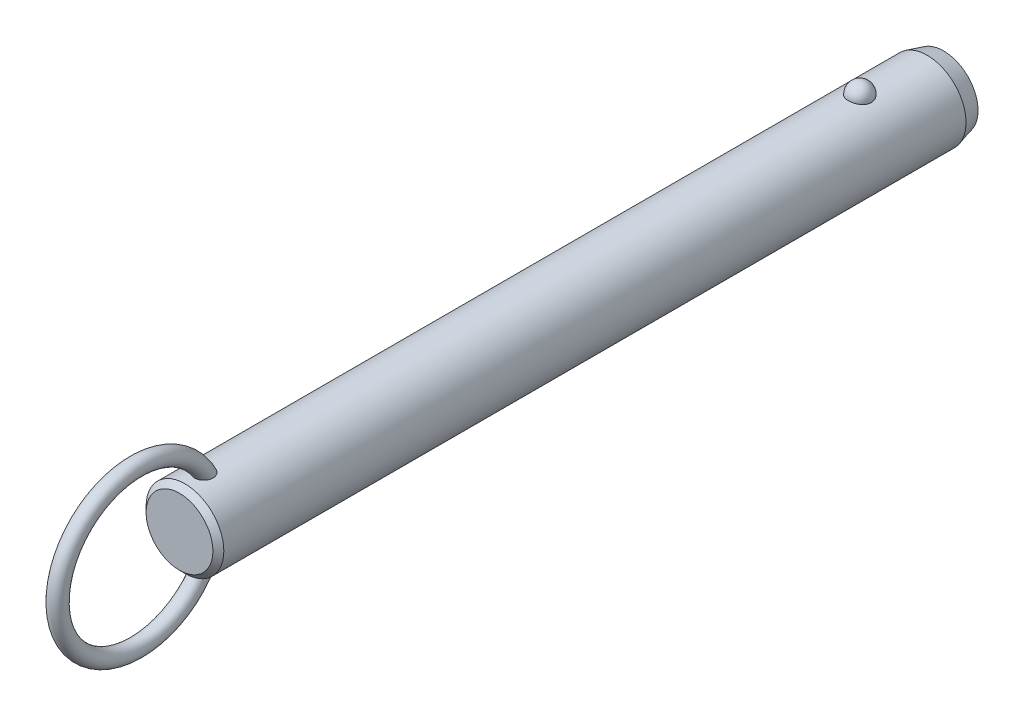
ISO-10303-21;
HEADER;
FILE_DESCRIPTION(('STEP AP214'),'2;1');
FILE_NAME('part.step','',(''),(''),'','','');
FILE_SCHEMA(('AUTOMOTIVE_DESIGN { 1 0 10303 214 1 1 1 1 }'));
ENDSEC;
DATA;
#1=APPLICATION_CONTEXT('core data for automotive mechanical design processes');
#2=APPLICATION_PROTOCOL_DEFINITION('international standard','automotive_design',2000,#1);
#3=PRODUCT_CONTEXT('',#1,'mechanical');
#4=PRODUCT('Part','Part','',(#3));
#5=PRODUCT_RELATED_PRODUCT_CATEGORY('part','',(#4));
#6=PRODUCT_DEFINITION_FORMATION('','',#4);
#7=PRODUCT_DEFINITION_CONTEXT('part definition',#1,'design');
#8=PRODUCT_DEFINITION('design','',#6,#7);
#9=PRODUCT_DEFINITION_SHAPE('','',#8);
#10=(LENGTH_UNIT() NAMED_UNIT(*) SI_UNIT(.MILLI.,.METRE.));
#11=(NAMED_UNIT(*) PLANE_ANGLE_UNIT() SI_UNIT($,.RADIAN.));
#12=(NAMED_UNIT(*) SI_UNIT($,.STERADIAN.) SOLID_ANGLE_UNIT());
#13=UNCERTAINTY_MEASURE_WITH_UNIT(LENGTH_MEASURE(1.E-05),#10,'distance_accuracy_value','');
#14=(GEOMETRIC_REPRESENTATION_CONTEXT(3) GLOBAL_UNCERTAINTY_ASSIGNED_CONTEXT((#13)) GLOBAL_UNIT_ASSIGNED_CONTEXT((#10,
#11,#12)) REPRESENTATION_CONTEXT('',''));
#15=CARTESIAN_POINT('',(0.,0.,0.));
#16=DIRECTION('',(0.,0.,1.));
#17=DIRECTION('',(1.,0.,0.));
#18=AXIS2_PLACEMENT_3D('',#15,#16,#17);
#19=CARTESIAN_POINT('',(0.,0.,114.3));
#20=DIRECTION('',(0.,0.,-1.));
#21=DIRECTION('',(-1.,0.,0.));
#22=AXIS2_PLACEMENT_3D('',#19,#20,#21);
#23=CYLINDRICAL_SURFACE('',#22,7.1);
#24=CARTESIAN_POINT('',(2.0769088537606,6.78943661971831,-2.1));
#25=CARTESIAN_POINT('',(2.07690739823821,6.78943796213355,-1.98268154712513));
#26=CARTESIAN_POINT('',(2.06738130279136,6.79237331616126,-1.86534506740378));
#27=CARTESIAN_POINT('',(2.0295040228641,6.8037853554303,-1.63400788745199));
#28=CARTESIAN_POINT('',(2.00114757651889,6.81226358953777,-1.52000812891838));
#29=CARTESIAN_POINT('',(1.92632025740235,6.83379798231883,-1.29863433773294));
#30=CARTESIAN_POINT('',(1.87985726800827,6.84685214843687,-1.19125744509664));
#31=CARTESIAN_POINT('',(1.76995205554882,6.87608091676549,-0.98604657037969));
#32=CARTESIAN_POINT('',(1.70650980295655,6.8922555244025,-0.88821260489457));
#33=CARTESIAN_POINT('',(1.5638119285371,6.92602930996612,-0.704242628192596));
#34=CARTESIAN_POINT('',(1.4844714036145,6.94363582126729,-0.618173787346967));
#35=CARTESIAN_POINT('',(1.31221746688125,6.97823658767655,-0.460740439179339));
#36=CARTESIAN_POINT('',(1.21930409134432,6.99523084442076,-0.389375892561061));
#37=CARTESIAN_POINT('',(1.02268781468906,7.02666176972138,-0.263547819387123));
#38=CARTESIAN_POINT('',(0.91902009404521,7.04110638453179,-0.209031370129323));
#39=CARTESIAN_POINT('',(0.703548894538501,7.06588726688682,-0.118163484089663));
#40=CARTESIAN_POINT('',(0.591746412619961,7.07622403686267,-0.0818098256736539));
#41=CARTESIAN_POINT('',(0.365557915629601,7.09147068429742,-0.0288711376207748));
#42=CARTESIAN_POINT('',(0.251267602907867,7.09648447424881,-0.0119070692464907));
#43=CARTESIAN_POINT('',(0.0213499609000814,7.10089837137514,0.00304925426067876));
#44=CARTESIAN_POINT('',(-0.0942772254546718,7.10029907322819,0.00104351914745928));
#45=CARTESIAN_POINT('',(-0.321651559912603,7.09360829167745,-0.0216931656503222));
#46=CARTESIAN_POINT('',(-0.433431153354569,7.08760388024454,-0.0421272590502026));
#47=CARTESIAN_POINT('',(-0.651862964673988,7.07086131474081,-0.100729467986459));
#48=CARTESIAN_POINT('',(-0.758515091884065,7.06012307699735,-0.138897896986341));
#49=CARTESIAN_POINT('',(-0.964449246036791,7.03496097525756,-0.232213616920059));
#50=CARTESIAN_POINT('',(-1.06368095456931,7.02051445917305,-0.287465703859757));
#51=CARTESIAN_POINT('',(-1.25145353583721,6.98948740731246,-0.413383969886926));
#52=CARTESIAN_POINT('',(-1.33999321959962,6.97290663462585,-0.48405186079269));
#53=CARTESIAN_POINT('',(-1.50591604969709,6.93898770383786,-0.640594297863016));
#54=CARTESIAN_POINT('',(-1.58302488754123,6.92164094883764,-0.726757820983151));
#55=CARTESIAN_POINT('',(-1.72189320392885,6.8884103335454,-0.91092752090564));
#56=CARTESIAN_POINT('',(-1.78365144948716,6.87252659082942,-1.008934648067));
#57=CARTESIAN_POINT('',(-1.89101272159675,6.84377189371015,-1.21549497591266));
#58=CARTESIAN_POINT('',(-1.93639553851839,6.83094274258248,-1.32416860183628));
#59=CARTESIAN_POINT('',(-2.00874275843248,6.81002070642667,-1.54791500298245));
#60=CARTESIAN_POINT('',(-2.03570774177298,6.80192767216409,-1.66298757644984));
#61=CARTESIAN_POINT('',(-2.07047276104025,6.7914266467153,-1.89571453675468));
#62=CARTESIAN_POINT('',(-2.07835878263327,6.78899315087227,-2.01335491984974));
#63=CARTESIAN_POINT('',(-2.07502083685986,6.79001409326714,-2.24833570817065));
#64=CARTESIAN_POINT('',(-2.06379746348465,6.7934683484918,-2.36567612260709));
#65=CARTESIAN_POINT('',(-2.02263913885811,6.80583442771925,-2.59603194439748));
#66=CARTESIAN_POINT('',(-1.99281127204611,6.81471501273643,-2.70906820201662));
#67=CARTESIAN_POINT('',(-1.91526639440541,6.83691232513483,-2.92836575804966));
#68=CARTESIAN_POINT('',(-1.8675486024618,6.85022924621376,-3.03462676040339));
#69=CARTESIAN_POINT('',(-1.75504492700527,6.87991336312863,-3.23806487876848));
#70=CARTESIAN_POINT('',(-1.69015924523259,6.89629822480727,-3.33518422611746));
#71=CARTESIAN_POINT('',(-1.54505404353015,6.93024852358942,-3.51697105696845));
#72=CARTESIAN_POINT('',(-1.46483385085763,6.94781401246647,-3.60163799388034));
#73=CARTESIAN_POINT('',(-1.29071406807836,6.98225977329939,-3.75654119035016));
#74=CARTESIAN_POINT('',(-1.19675650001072,6.99913673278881,-3.82671308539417));
#75=CARTESIAN_POINT('',(-0.997940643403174,7.03023618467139,-3.9501837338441));
#76=CARTESIAN_POINT('',(-0.89308318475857,7.04445887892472,-4.00348377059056));
#77=CARTESIAN_POINT('',(-0.676902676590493,7.06848365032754,-4.09107242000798));
#78=CARTESIAN_POINT('',(-0.565686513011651,7.0783430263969,-4.12560889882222));
#79=CARTESIAN_POINT('',(-0.338739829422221,7.09282534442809,-4.17575450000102));
#80=CARTESIAN_POINT('',(-0.223009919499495,7.09744899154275,-4.19136617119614));
#81=CARTESIAN_POINT('',(0.00707628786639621,7.10090930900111,-4.20307965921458));
#82=CARTESIAN_POINT('',(0.121410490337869,7.09986531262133,-4.19958377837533));
#83=CARTESIAN_POINT('',(0.347815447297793,7.092380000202,-4.17411564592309));
#84=CARTESIAN_POINT('',(0.459886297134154,7.08593891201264,-4.15214417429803));
#85=CARTESIAN_POINT('',(0.678084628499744,7.06838983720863,-4.09049562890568));
#86=CARTESIAN_POINT('',(0.784237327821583,7.05730369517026,-4.05090137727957));
#87=CARTESIAN_POINT('',(0.988305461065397,7.03163139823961,-3.95511447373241));
#88=CARTESIAN_POINT('',(1.08622031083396,7.01704499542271,-3.89892064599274));
#89=CARTESIAN_POINT('',(1.27284490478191,6.98562668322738,-3.77035541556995));
#90=CARTESIAN_POINT('',(1.36137372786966,6.96876135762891,-3.69772964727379));
#91=CARTESIAN_POINT('',(1.52509486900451,6.93477412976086,-3.53878279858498));
#92=CARTESIAN_POINT('',(1.60028496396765,6.91765218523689,-3.45245943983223));
#93=CARTESIAN_POINT('',(1.73681688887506,6.88465753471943,-3.26658774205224));
#94=CARTESIAN_POINT('',(1.79785966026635,6.86881574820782,-3.16681408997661));
#95=CARTESIAN_POINT('',(1.90265327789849,6.84053157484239,-2.95814408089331));
#96=CARTESIAN_POINT('',(1.94640861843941,6.82808830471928,-2.84925010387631));
#97=CARTESIAN_POINT('',(2.01274378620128,6.80881460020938,-2.63454318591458));
#98=CARTESIAN_POINT('',(2.03676193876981,6.80160856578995,-2.52920574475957));
#99=CARTESIAN_POINT('',(2.06884490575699,6.79191902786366,-2.3159172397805));
#100=CARTESIAN_POINT('',(2.07691019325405,6.78943538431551,-2.20796625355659));
#101=CARTESIAN_POINT('',(2.0769088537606,6.78943661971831,-2.1));
#102=B_SPLINE_CURVE_WITH_KNOTS('',3,(#24,#25,#26,#27,#28,#29,#30,#31,#32,#33,#34,#35,#36,#37,
#38,#39,#40,#41,#42,#43,#44,#45,#46,#47,#48,#49,#50,#51,#52,#53,#54,#55,#56,#57,#58,#59,#60,#61,
#62,#63,#64,#65,#66,#67,#68,#69,#70,#71,#72,#73,#74,#75,#76,#77,#78,#79,#80,#81,#82,#83,#84,#85,
#86,#87,#88,#89,#90,#91,#92,#93,#94,#95,#96,#97,#98,#99,#100,#101),.UNSPECIFIED.,.T.,.F.,(4,2,2,
2,2,2,2,2,2,2,2,2,2,2,2,2,2,2,2,2,2,2,2,2,2,2,2,2,2,2,2,2,2,2,2,2,2,2,4),(0.,0.351568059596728,
0.703234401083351,1.05474780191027,1.40626181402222,1.75970563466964,2.11314851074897,
2.4654696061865,2.81774759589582,3.16301449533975,3.50824481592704,3.84801136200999,
4.18778391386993,4.52968352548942,4.87162112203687,5.22076181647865,5.56993054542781,
5.92363364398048,6.27732559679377,6.62942052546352,6.98150450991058,7.33158042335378,
7.68167162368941,8.03384443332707,8.38603269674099,8.73975272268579,9.09344583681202,
9.44234545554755,9.79119807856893,10.1327344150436,10.4742563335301,10.8141898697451,
11.1541474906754,11.4997793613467,11.8454687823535,12.1979079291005,12.5502553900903,
12.8738073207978,13.1973496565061),.UNSPECIFIED.);
#103=CARTESIAN_POINT('',(2.0769088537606,6.78943661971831,-2.1));
#104=VERTEX_POINT('',#103);
#105=EDGE_CURVE('E41',#104,#104,#102,.T.);
#106=ORIENTED_EDGE('',*,*,#105,.T.);
#107=EDGE_LOOP('',(#106));
#108=FACE_BOUND('',#107,.T.);
#109=CARTESIAN_POINT('',(0.,0.,121.22));
#110=DIRECTION('',(0.,0.,1.));
#111=DIRECTION('',(1.,0.,0.));
#112=AXIS2_PLACEMENT_3D('',#109,#110,#111);
#113=CIRCLE('',#112,7.1);
#114=CARTESIAN_POINT('',(7.1,0.,121.22));
#115=VERTEX_POINT('',#114);
#116=EDGE_CURVE('E10',#115,#115,#113,.F.);
#117=ORIENTED_EDGE('',*,*,#116,.T.);
#118=EDGE_LOOP('',(#117));
#119=FACE_BOUND('',#118,.T.);
#120=CARTESIAN_POINT('',(-0.429539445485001,-7.08699541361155,116.042921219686));
#121=CARTESIAN_POINT('',(-0.508331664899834,-7.08221999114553,116.066876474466));
#122=CARTESIAN_POINT('',(-0.585039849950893,-7.07624016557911,116.097457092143));
#123=CARTESIAN_POINT('',(-0.732082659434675,-7.06254296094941,116.171024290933));
#124=CARTESIAN_POINT('',(-0.802417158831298,-7.05482554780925,116.214011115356));
#125=CARTESIAN_POINT('',(-0.934722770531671,-7.03851844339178,116.311113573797));
#126=CARTESIAN_POINT('',(-0.996700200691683,-7.02992941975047,116.365220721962));
#127=CARTESIAN_POINT('',(-1.11079942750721,-7.01280697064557,116.482967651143));
#128=CARTESIAN_POINT('',(-1.16292136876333,-7.00427354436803,116.546607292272));
#129=CARTESIAN_POINT('',(-1.25705660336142,-6.98799959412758,116.682687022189));
#130=CARTESIAN_POINT('',(-1.2988803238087,-6.98027525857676,116.755259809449));
#131=CARTESIAN_POINT('',(-1.37069920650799,-6.96652886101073,116.906168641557));
#132=CARTESIAN_POINT('',(-1.40069157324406,-6.96050720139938,116.984506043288));
#133=CARTESIAN_POINT('',(-1.45043507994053,-6.95031881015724,117.150190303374));
#134=CARTESIAN_POINT('',(-1.46937115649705,-6.94630231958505,117.237789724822));
#135=CARTESIAN_POINT('',(-1.49424917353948,-6.94099239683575,117.414871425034));
#136=CARTESIAN_POINT('',(-1.50018601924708,-6.93970003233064,117.504354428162));
#137=CARTESIAN_POINT('',(-1.49978214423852,-6.93978815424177,117.694060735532));
#138=CARTESIAN_POINT('',(-1.49187639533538,-6.94150934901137,117.794279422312));
#139=CARTESIAN_POINT('',(-1.46177925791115,-6.94790814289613,117.992479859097));
#140=CARTESIAN_POINT('',(-1.43957541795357,-6.95258831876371,118.090459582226));
#141=CARTESIAN_POINT('',(-1.37783293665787,-6.96510647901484,118.29536292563));
#142=CARTESIAN_POINT('',(-1.33634073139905,-6.97328848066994,118.401680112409));
#143=CARTESIAN_POINT('',(-1.23686994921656,-6.99161706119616,118.606177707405));
#144=CARTESIAN_POINT('',(-1.17889192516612,-7.00176357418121,118.704358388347));
#145=CARTESIAN_POINT('',(-1.05875124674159,-7.02082898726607,118.872374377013));
#146=CARTESIAN_POINT('',(-0.999247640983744,-7.02963746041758,118.944123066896));
#147=CARTESIAN_POINT('',(-0.869494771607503,-7.04686074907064,119.077195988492));
#148=CARTESIAN_POINT('',(-0.799263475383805,-7.05527619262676,119.138537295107));
#149=CARTESIAN_POINT('',(-0.665408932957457,-7.06899457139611,119.235131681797));
#150=CARTESIAN_POINT('',(-0.603817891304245,-7.07457275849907,119.273151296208));
#151=CARTESIAN_POINT('',(-0.47517283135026,-7.08437420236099,119.338758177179));
#152=CARTESIAN_POINT('',(-0.408123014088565,-7.08859848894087,119.366353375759));
#153=CARTESIAN_POINT('',(-0.269431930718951,-7.09522749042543,119.409256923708));
#154=CARTESIAN_POINT('',(-0.19775731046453,-7.09761688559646,119.424461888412));
#155=CARTESIAN_POINT('',(-0.0527849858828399,-7.10017268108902,119.440716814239));
#156=CARTESIAN_POINT('',(0.0205115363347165,-7.10034065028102,119.441776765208));
#157=CARTESIAN_POINT('',(0.156426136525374,-7.09855986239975,119.430461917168));
#158=CARTESIAN_POINT('',(0.219199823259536,-7.09688191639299,119.419806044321));
#159=CARTESIAN_POINT('',(0.342134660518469,-7.09201880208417,119.388537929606));
#160=CARTESIAN_POINT('',(0.402295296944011,-7.08883333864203,119.367923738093));
#161=CARTESIAN_POINT('',(0.520687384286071,-7.08113868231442,119.317212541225));
#162=CARTESIAN_POINT('',(0.578791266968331,-7.07658958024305,119.286827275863));
#163=CARTESIAN_POINT('',(0.690173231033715,-7.06659708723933,119.218367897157));
#164=CARTESIAN_POINT('',(0.74344785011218,-7.061153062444,119.180288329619));
#165=CARTESIAN_POINT('',(0.870947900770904,-7.04680292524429,119.076592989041));
#166=CARTESIAN_POINT('',(0.941828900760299,-7.0375580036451,119.006897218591));
#167=CARTESIAN_POINT('',(1.07136606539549,-7.01900793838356,118.856945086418));
#168=CARTESIAN_POINT('',(1.13000013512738,-7.00970271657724,118.776670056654));
#169=CARTESIAN_POINT('',(1.23579584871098,-6.99183327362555,118.606899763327));
#170=CARTESIAN_POINT('',(1.28274271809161,-6.98328455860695,118.517269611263));
#171=CARTESIAN_POINT('',(1.36351442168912,-6.96796352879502,118.332176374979));
#172=CARTESIAN_POINT('',(1.39733971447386,-6.96119115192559,118.236713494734));
#173=CARTESIAN_POINT('',(1.45579181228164,-6.94922464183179,118.02530928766));
#174=CARTESIAN_POINT('',(1.47790145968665,-6.94449000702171,117.908631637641));
#175=CARTESIAN_POINT('',(1.50168752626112,-6.93938731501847,117.673015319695));
#176=CARTESIAN_POINT('',(1.50336085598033,-6.93901991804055,117.55407631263));
#177=CARTESIAN_POINT('',(1.48486516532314,-6.9430010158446,117.32360799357));
#178=CARTESIAN_POINT('',(1.46573441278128,-6.9471253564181,117.211995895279));
#179=CARTESIAN_POINT('',(1.40606892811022,-6.95944667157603,116.994886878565));
#180=CARTESIAN_POINT('',(1.36556446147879,-6.96763788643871,116.8893815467));
#181=CARTESIAN_POINT('',(1.27082700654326,-6.98548038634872,116.704287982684));
#182=CARTESIAN_POINT('',(1.21949810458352,-6.99473841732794,116.623171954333));
#183=CARTESIAN_POINT('',(1.10242050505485,-7.01414069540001,116.472227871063));
#184=CARTESIAN_POINT('',(1.0366811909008,-7.02428436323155,116.40239252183));
#185=CARTESIAN_POINT('',(0.900559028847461,-7.04295285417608,116.283573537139));
#186=CARTESIAN_POINT('',(0.831428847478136,-7.05153466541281,116.233157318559));
#187=CARTESIAN_POINT('',(0.685291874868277,-7.06723150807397,116.145142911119));
#188=CARTESIAN_POINT('',(0.608287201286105,-7.0743469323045,116.107541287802));
#189=CARTESIAN_POINT('',(0.451878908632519,-7.08602232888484,116.047491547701));
#190=CARTESIAN_POINT('',(0.372686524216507,-7.09067127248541,116.024508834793));
#191=CARTESIAN_POINT('',(0.211477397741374,-7.09730788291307,115.992035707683));
#192=CARTESIAN_POINT('',(0.12946098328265,-7.09929585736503,115.98254373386));
#193=CARTESIAN_POINT('',(-0.0332905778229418,-7.10037858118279,115.977351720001));
#194=CARTESIAN_POINT('',(-0.114016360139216,-7.09953334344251,115.981365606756));
#195=CARTESIAN_POINT('',(-0.273670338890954,-7.09517338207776,116.002454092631));
#196=CARTESIAN_POINT('',(-0.352598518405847,-7.09165863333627,116.019528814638));
#197=CARTESIAN_POINT('',(-0.429539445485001,-7.08699541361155,116.042921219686));
#198=B_SPLINE_CURVE_WITH_KNOTS('',3,(#120,#121,#122,#123,#124,#125,#126,#127,#128,#129,#130,
#131,#132,#133,#134,#135,#136,#137,#138,#139,#140,#141,#142,#143,#144,#145,#146,#147,#148,#149,
#150,#151,#152,#153,#154,#155,#156,#157,#158,#159,#160,#161,#162,#163,#164,#165,#166,#167,#168,
#169,#170,#171,#172,#173,#174,#175,#176,#177,#178,#179,#180,#181,#182,#183,#184,#185,#186,#187,
#188,#189,#190,#191,#192,#193,#194,#195,#196,#197),.UNSPECIFIED.,.T.,.F.,(4,2,2,2,2,2,2,2,2,2,2,
2,2,2,2,2,2,2,2,2,2,2,2,2,2,2,2,2,2,2,2,2,2,2,2,2,2,2,4),(0.,0.247183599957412,
0.494372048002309,0.741372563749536,0.988369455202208,1.23962059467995,1.49093106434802,
1.75897818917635,2.02713035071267,2.32758265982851,2.62829697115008,2.97008736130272,
3.31186629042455,3.59175319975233,3.87117637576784,4.08813841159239,4.30493502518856,
4.52352259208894,4.7419557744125,4.93215328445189,5.12238804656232,5.31884850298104,
5.51544871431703,5.81332317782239,6.11173048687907,6.41527266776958,6.71880423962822,
7.07358156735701,7.42841252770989,7.76631485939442,8.10373999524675,8.39142246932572,
8.67891817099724,8.93560332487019,9.19221962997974,9.43881106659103,9.68537399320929,
9.92674752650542,10.1681233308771),.UNSPECIFIED.);
#199=CARTESIAN_POINT('',(-0.429539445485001,-7.08699541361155,116.042921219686));
#200=VERTEX_POINT('',#199);
#201=EDGE_CURVE('E59',#200,#200,#198,.T.);
#202=ORIENTED_EDGE('',*,*,#201,.T.);
#203=EDGE_LOOP('',(#202));
#204=FACE_BOUND('',#203,.T.);
#205=CARTESIAN_POINT('',(-0.429539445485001,7.08699541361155,116.042921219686));
#206=CARTESIAN_POINT('',(-0.351665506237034,7.09171429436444,116.019246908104));
#207=CARTESIAN_POINT('',(-0.271733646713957,7.09525896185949,116.002036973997));
#208=CARTESIAN_POINT('',(-0.110026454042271,7.09960839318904,115.981005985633));
#209=CARTESIAN_POINT('',(-0.0282502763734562,7.10041187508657,115.977191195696));
#210=CARTESIAN_POINT('',(0.134782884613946,7.09918849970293,115.983059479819));
#211=CARTESIAN_POINT('',(0.21603995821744,7.09716214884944,115.99274013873));
#212=CARTESIAN_POINT('',(0.375730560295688,7.09050177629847,116.025347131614));
#213=CARTESIAN_POINT('',(0.454164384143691,7.08586802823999,116.048272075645));
#214=CARTESIAN_POINT('',(0.606025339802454,7.07449911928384,116.106771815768));
#215=CARTESIAN_POINT('',(0.679451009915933,7.06776334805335,116.142350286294));
#216=CARTESIAN_POINT('',(0.81923414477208,7.05292866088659,116.225175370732));
#217=CARTESIAN_POINT('',(0.885591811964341,7.04482978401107,116.272421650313));
#218=CARTESIAN_POINT('',(1.00993211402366,7.02808709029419,116.377590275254));
#219=CARTESIAN_POINT('',(1.06785399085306,7.01943990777,116.435583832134));
#220=CARTESIAN_POINT('',(1.17342527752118,7.00256662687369,116.560301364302));
#221=CARTESIAN_POINT('',(1.22107408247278,6.99434055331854,116.627025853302));
#222=CARTESIAN_POINT('',(1.30652927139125,6.97889183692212,116.769362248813));
#223=CARTESIAN_POINT('',(1.34399711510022,6.97170674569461,116.845180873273));
#224=CARTESIAN_POINT('',(1.40682616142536,6.95930080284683,117.001810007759));
#225=CARTESIAN_POINT('',(1.43218374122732,6.95408053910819,117.08262200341));
#226=CARTESIAN_POINT('',(1.47246409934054,6.94566853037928,117.253531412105));
#227=CARTESIAN_POINT('',(1.48642590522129,6.9426653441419,117.34386307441));
#228=CARTESIAN_POINT('',(1.5011410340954,6.93949744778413,117.525619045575));
#229=CARTESIAN_POINT('',(1.50188917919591,6.93933385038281,117.617043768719));
#230=CARTESIAN_POINT('',(1.49030464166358,6.94183245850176,117.81084381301));
#231=CARTESIAN_POINT('',(1.47627413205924,6.94486147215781,117.913112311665));
#232=CARTESIAN_POINT('',(1.43356351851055,6.95380194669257,118.114471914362));
#233=CARTESIAN_POINT('',(1.4048676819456,6.95971650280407,118.213559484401));
#234=CARTESIAN_POINT('',(1.32908750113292,6.97461208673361,118.418908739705));
#235=CARTESIAN_POINT('',(1.28011435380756,6.98388945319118,118.524456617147));
#236=CARTESIAN_POINT('',(1.16520357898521,7.00397743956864,118.725760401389));
#237=CARTESIAN_POINT('',(1.09927694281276,7.01478706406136,118.821522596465));
#238=CARTESIAN_POINT('',(0.969361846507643,7.03373936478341,118.976756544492));
#239=CARTESIAN_POINT('',(0.909042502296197,7.04187023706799,119.039303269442));
#240=CARTESIAN_POINT('',(0.779178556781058,7.05741732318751,119.154053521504));
#241=CARTESIAN_POINT('',(0.709649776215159,7.06483472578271,119.206274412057));
#242=CARTESIAN_POINT('',(0.576854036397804,7.0767751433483,119.288113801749));
#243=CARTESIAN_POINT('',(0.515118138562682,7.08158033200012,119.320164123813));
#244=CARTESIAN_POINT('',(0.387127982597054,7.08972701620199,119.373765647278));
#245=CARTESIAN_POINT('',(0.320877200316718,7.09306962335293,119.395324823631));
#246=CARTESIAN_POINT('',(0.18504126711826,7.09791507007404,119.426400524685));
#247=CARTESIAN_POINT('',(0.115437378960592,7.09940591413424,119.435838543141));
#248=CARTESIAN_POINT('',(-0.024315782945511,7.10030171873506,119.441522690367));
#249=CARTESIAN_POINT('',(-0.0944648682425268,7.0997073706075,119.437773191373));
#250=CARTESIAN_POINT('',(-0.225713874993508,7.09668414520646,119.418508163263));
#251=CARTESIAN_POINT('',(-0.287006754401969,7.09444865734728,119.404232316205));
#252=CARTESIAN_POINT('',(-0.406555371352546,7.08860360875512,119.366368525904));
#253=CARTESIAN_POINT('',(-0.464809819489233,7.08499346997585,119.342776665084));
#254=CARTESIAN_POINT('',(-0.594955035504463,7.07541654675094,119.278923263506));
#255=CARTESIAN_POINT('',(-0.665389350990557,7.06906574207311,119.235753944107));
#256=CARTESIAN_POINT('',(-0.798242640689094,7.05530261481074,119.138587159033));
#257=CARTESIAN_POINT('',(-0.860645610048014,7.0478882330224,119.084568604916));
#258=CARTESIAN_POINT('',(-0.99424943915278,7.03045217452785,118.950996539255));
#259=CARTESIAN_POINT('',(-1.06260129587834,7.02030745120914,118.868614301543));
#260=CARTESIAN_POINT('',(-1.18502045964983,7.00068382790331,118.693843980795));
#261=CARTESIAN_POINT('',(-1.239076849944,6.99120544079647,118.601448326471));
#262=CARTESIAN_POINT('',(-1.33335589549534,6.97384343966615,118.408008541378));
#263=CARTESIAN_POINT('',(-1.3733613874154,6.96598557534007,118.306856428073));
#264=CARTESIAN_POINT('',(-1.43770677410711,6.9529905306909,118.099504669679));
#265=CARTESIAN_POINT('',(-1.46204473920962,6.94785368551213,117.99330440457));
#266=CARTESIAN_POINT('',(-1.49537533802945,6.94076296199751,117.768231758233));
#267=CARTESIAN_POINT('',(-1.50273564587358,6.93914842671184,117.64909751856));
#268=CARTESIAN_POINT('',(-1.4954555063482,6.94072368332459,117.411470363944));
#269=CARTESIAN_POINT('',(-1.48082914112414,6.94391040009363,117.292977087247));
#270=CARTESIAN_POINT('',(-1.43076401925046,6.95438579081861,117.073432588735));
#271=CARTESIAN_POINT('',(-1.39762227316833,6.96121852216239,116.971841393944));
#272=CARTESIAN_POINT('',(-1.31211274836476,6.97783941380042,116.777351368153));
#273=CARTESIAN_POINT('',(-1.2597660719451,6.98762432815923,116.68444313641));
#274=CARTESIAN_POINT('',(-1.14583073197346,7.00713153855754,116.524160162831));
#275=CARTESIAN_POINT('',(-1.0866594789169,7.01665982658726,116.455035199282));
#276=CARTESIAN_POINT('',(-0.956606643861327,7.03556646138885,116.328878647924));
#277=CARTESIAN_POINT('',(-0.885737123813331,7.04494495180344,116.271834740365));
#278=CARTESIAN_POINT('',(-0.751558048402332,7.06035735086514,116.183100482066));
#279=CARTESIAN_POINT('',(-0.690120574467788,7.0666695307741,116.148593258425));
#280=CARTESIAN_POINT('',(-0.562815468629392,7.07794609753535,116.088750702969));
#281=CARTESIAN_POINT('',(-0.496948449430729,7.08291067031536,116.063414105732));
#282=CARTESIAN_POINT('',(-0.429539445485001,7.08699541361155,116.042921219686));
#283=B_SPLINE_CURVE_WITH_KNOTS('',3,(#205,#206,#207,#208,#209,#210,#211,#212,#213,#214,#215,
#216,#217,#218,#219,#220,#221,#222,#223,#224,#225,#226,#227,#228,#229,#230,#231,#232,#233,#234,
#235,#236,#237,#238,#239,#240,#241,#242,#243,#244,#245,#246,#247,#248,#249,#250,#251,#252,#253,
#254,#255,#256,#257,#258,#259,#260,#261,#262,#263,#264,#265,#266,#267,#268,#269,#270,#271,#272,
#273,#274,#275,#276,#277,#278,#279,#280,#281,#282),.UNSPECIFIED.,.T.,.F.,(4,2,2,2,2,2,2,2,2,2,2,
2,2,2,2,2,2,2,2,2,2,2,2,2,2,2,2,2,2,2,2,2,2,2,2,2,2,2,4),(0.,0.244335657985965,
0.488785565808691,0.73319173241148,0.977572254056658,1.22202379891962,1.46646834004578,
1.71259457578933,1.95873529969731,2.21226768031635,2.46587585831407,2.73913816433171,
3.01250754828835,3.32109936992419,3.63002293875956,3.9786351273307,4.32702187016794,
4.58793945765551,4.84841449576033,5.05676704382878,5.26496096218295,5.47449661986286,
5.68396281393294,5.87205447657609,6.06022532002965,6.30743751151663,6.55513496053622,
6.87602468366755,7.19715875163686,7.52305774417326,7.84899686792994,8.20516155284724,
8.56109821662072,8.88040084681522,9.19935367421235,9.4723628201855,9.74509220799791,
9.95662250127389,10.1681235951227),.UNSPECIFIED.);
#284=CARTESIAN_POINT('',(-0.429539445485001,7.08699541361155,116.042921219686));
#285=VERTEX_POINT('',#284);
#286=EDGE_CURVE('E67',#285,#285,#283,.T.);
#287=ORIENTED_EDGE('',*,*,#286,.T.);
#288=EDGE_LOOP('',(#287));
#289=FACE_BOUND('',#288,.T.);
#290=CARTESIAN_POINT('',(0.,0.,-14.4));
#291=DIRECTION('',(0.,0.,-1.));
#292=DIRECTION('',(-1.,0.,0.));
#293=AXIS2_PLACEMENT_3D('',#290,#291,#292);
#294=CIRCLE('',#293,7.1);
#295=CARTESIAN_POINT('',(-7.1,0.,-14.4));
#296=VERTEX_POINT('',#295);
#297=EDGE_CURVE('E56',#296,#296,#294,.F.);
#298=ORIENTED_EDGE('',*,*,#297,.T.);
#299=EDGE_LOOP('',(#298));
#300=FACE_BOUND('',#299,.T.);
#301=ADVANCED_FACE('F37',(#108,#119,#204,#289,#300),#23,.T.);
#302=CARTESIAN_POINT('',(0.,0.,-17.4));
#303=DIRECTION('',(0.,0.,-1.));
#304=DIRECTION('',(-1.,0.,0.));
#305=AXIS2_PLACEMENT_3D('',#302,#303,#304);
#306=PLANE('',#305);
#307=CARTESIAN_POINT('',(0.,0.,-17.4));
#308=DIRECTION('',(0.,0.,-1.));
#309=DIRECTION('',(-1.,0.,0.));
#310=AXIS2_PLACEMENT_3D('',#307,#308,#309);
#311=CIRCLE('',#310,6.29615242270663);
#312=CARTESIAN_POINT('',(-6.29615242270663,0.,-17.4));
#313=VERTEX_POINT('',#312);
#314=EDGE_CURVE('E66',#313,#313,#311,.T.);
#315=ORIENTED_EDGE('',*,*,#314,.T.);
#316=EDGE_LOOP('',(#315));
#317=FACE_BOUND('',#316,.T.);
#318=ADVANCED_FACE('F85',(#317),#306,.T.);
#319=CARTESIAN_POINT('',(0.,0.,-17.4));
#320=DIRECTION('',(0.,0.,1.));
#321=DIRECTION('',(1.,0.,0.));
#322=AXIS2_PLACEMENT_3D('',#319,#320,#321);
#323=CONICAL_SURFACE('',#322,6.29615242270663,0.261799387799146);
#324=ORIENTED_EDGE('',*,*,#297,.F.);
#325=EDGE_LOOP('',(#324));
#326=FACE_BOUND('',#325,.T.);
#327=ORIENTED_EDGE('',*,*,#314,.F.);
#328=EDGE_LOOP('',(#327));
#329=FACE_BOUND('',#328,.T.);
#330=ADVANCED_FACE('F83',(#326,#329),#323,.T.);
#331=CARTESIAN_POINT('',(0.,0.,122.22));
#332=DIRECTION('',(0.,0.,1.));
#333=DIRECTION('',(1.,0.,0.));
#334=AXIS2_PLACEMENT_3D('',#331,#332,#333);
#335=PLANE('',#334);
#336=CARTESIAN_POINT('',(0.,0.,122.22));
#337=DIRECTION('',(0.,0.,1.));
#338=DIRECTION('',(1.,0.,0.));
#339=AXIS2_PLACEMENT_3D('',#336,#337,#338);
#340=CIRCLE('',#339,6.09999999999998);
#341=CARTESIAN_POINT('',(6.09999999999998,0.,122.22));
#342=VERTEX_POINT('',#341);
#343=EDGE_CURVE('E50',#342,#342,#340,.T.);
#344=ORIENTED_EDGE('',*,*,#343,.T.);
#345=EDGE_LOOP('',(#344));
#346=FACE_BOUND('',#345,.T.);
#347=ADVANCED_FACE('F77',(#346),#335,.T.);
#348=CARTESIAN_POINT('',(0.,0.,130.15));
#349=DIRECTION('',(1.,0.,0.));
#350=DIRECTION('',(0.,0.,-1.));
#351=AXIS2_PLACEMENT_3D('',#348,#349,#350);
#352=TOROIDAL_SURFACE('',#351,14.35,1.5);
#353=ORIENTED_EDGE('',*,*,#286,.F.);
#354=EDGE_LOOP('',(#353));
#355=FACE_BOUND('',#354,.T.);
#356=ORIENTED_EDGE('',*,*,#201,.F.);
#357=EDGE_LOOP('',(#356));
#358=FACE_BOUND('',#357,.T.);
#359=ADVANCED_FACE('F73',(#355,#358),#352,.T.);
#360=CARTESIAN_POINT('',(0.,0.,122.22));
#361=DIRECTION('',(0.,0.,-1.));
#362=DIRECTION('',(-1.,0.,0.));
#363=AXIS2_PLACEMENT_3D('',#360,#361,#362);
#364=CONICAL_SURFACE('',#363,6.09999999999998,0.785398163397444);
#365=ORIENTED_EDGE('',*,*,#116,.F.);
#366=EDGE_LOOP('',(#365));
#367=FACE_BOUND('',#366,.T.);
#368=ORIENTED_EDGE('',*,*,#343,.F.);
#369=EDGE_LOOP('',(#368));
#370=FACE_BOUND('',#369,.T.);
#371=ADVANCED_FACE('F39',(#367,#370),#364,.T.);
#372=CARTESIAN_POINT('',(0.,7.1,-2.1));
#373=DIRECTION('',(0.,1.,0.));
#374=DIRECTION('',(0.,0.,1.));
#375=AXIS2_PLACEMENT_3D('',#372,#373,#374);
#376=SPHERICAL_SURFACE('',#375,2.10000000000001);
#377=ORIENTED_EDGE('',*,*,#105,.F.);
#378=EDGE_LOOP('',(#377));
#379=FACE_BOUND('',#378,.T.);
#380=ADVANCED_FACE('F79',(#379),#376,.T.);
#381=CLOSED_SHELL('',(#301,#318,#330,#347,#359,#371,#380));
#382=MANIFOLD_SOLID_BREP('B2',#381);
#383=ADVANCED_BREP_SHAPE_REPRESENTATION('',(#18,#382),#14);
#384=SHAPE_DEFINITION_REPRESENTATION(#9,#383);
ENDSEC;
END-ISO-10303-21;
